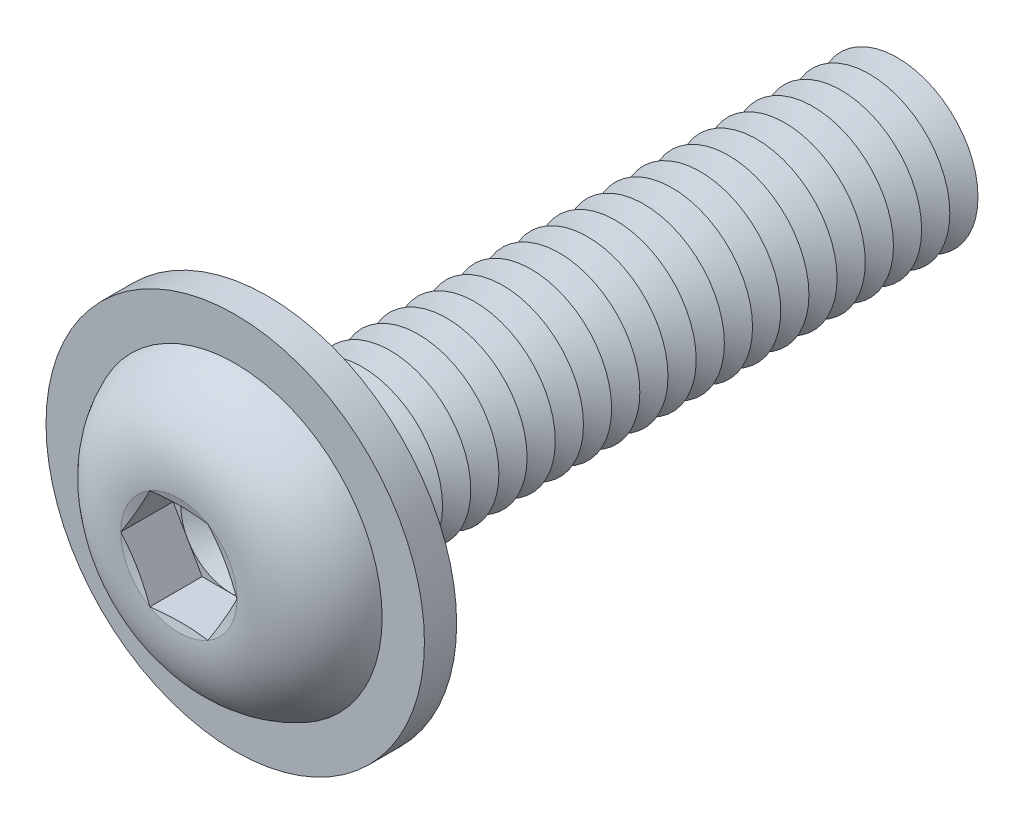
from build123d import *

# Parameters (mm, degrees)
FILLET1_R           = 0.35
LPATTERN1_COUNT     = 22
LPATTERN1_PITCH     = 0.7
CUT_EXTRUDE1_DEPTH  = 1.3
SKETCH5_R           = 4.7
SKETCH5_R_2         = 2.35
BOSS_EXTRUDE1_DEPTH = 0.8


with BuildPart() as part:
    # Sketch1 → Revolve1 (revolve)
    with BuildSketch(Plane(origin=(0, 0, 0), x_dir=(0, 0, -1), z_dir=(1, 0, 0)), mode=Mode.PRIVATE) as revolve1_sk:
        with BuildLine():
            Line((0, 2), (0, 3.8))
            ThreePointArc((0, 3.8), (-1.611961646, 3.099623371), (-2.2, 1.443375))
            Line((-2.2, 1.443375), (-2.006624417, 0.7216875))
            Line((-2.006624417, 0.7216875), (-2.2, 0.7216875))
            Line((-2.2, 0.7216875), (-2.2, 0))
            Line((-2.2, 0), (16, 0))
            Line((16, 0), (16, 2))
            Line((16, 2), (0, 2))
        make_face()
    revolve(revolve1_sk.sketch.rotate(Axis((0, 0, -16), (0, 0, 1)), 90), axis=Axis((0, 0, -16), (0, 0, 1)))

    # Fillet1
    fillet1_edges = [part.edges().sort_by_distance(p)[0] for p in [
        (2, 0, 0),
    ]]
    fillet(fillet1_edges, radius=FILLET1_R)

    # Sketch2 → Cut-Revolve1 (revolve, cut)
    with BuildSketch(Plane(origin=(0, 0, 0), x_dir=(0, 0, -1), z_dir=(1, 0, 0)), mode=Mode.PRIVATE) as cut_revolve1_sk:
        Polygon((15.65, 2), (16.35, 2), (16, 1.393782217), align=None)
    cut_revolve1 = revolve(cut_revolve1_sk.sketch.rotate(Axis((0, 0, -16), (0, 0, -1)), 270), axis=Axis((0, 0, -16), (0, 0, -1)), mode=Mode.SUBTRACT)

    # LPattern1: Cut-Revolve1 ×22
    with Locations(*[(0, 0, i * LPATTERN1_PITCH) for i in range(1, LPATTERN1_COUNT)]):
        add(cut_revolve1, mode=Mode.SUBTRACT)

    # Sketch3 → Cut-Extrude1 (cut)
    with BuildSketch(Plane.XY.offset(2.2)):
        Polygon((0.7216875, 1.249999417), (-0.7216875, 1.249999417), (-1.443375, 0), (-0.7216875, -1.249999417), (0.7216875, -1.249999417), (1.443375, 0), align=None)
    extrude(amount=-CUT_EXTRUDE1_DEPTH, mode=Mode.SUBTRACT)

    # Cut-Extrude2 cone 1 section (on through the dimple's axis) → Cut-Extrude2 (revolve, cut)
    with BuildSketch(Plane(origin=(0, 0, 0.9), x_dir=(0, -1, 0), z_dir=(1, 0, 0))):
        Polygon((0, 0), (1.249999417, 0), (0, 0.7216875), align=None)
    revolve(axis=Axis((0, 0, 0.9), (0, 0, -1)), mode=Mode.SUBTRACT)

    # Sketch5 → Boss-Extrude1 (add)
    with BuildSketch(Plane(origin=(0, 0, 0), x_dir=(-1, 0, 0), z_dir=(0, 0, -1))):
        with Locations(Location((0, 0, 0), (0, 0, 90))):
            Circle(SKETCH5_R)
        Circle(SKETCH5_R_2, mode=Mode.SUBTRACT)
    extrude(amount=-BOSS_EXTRUDE1_DEPTH)


solid = part.part
